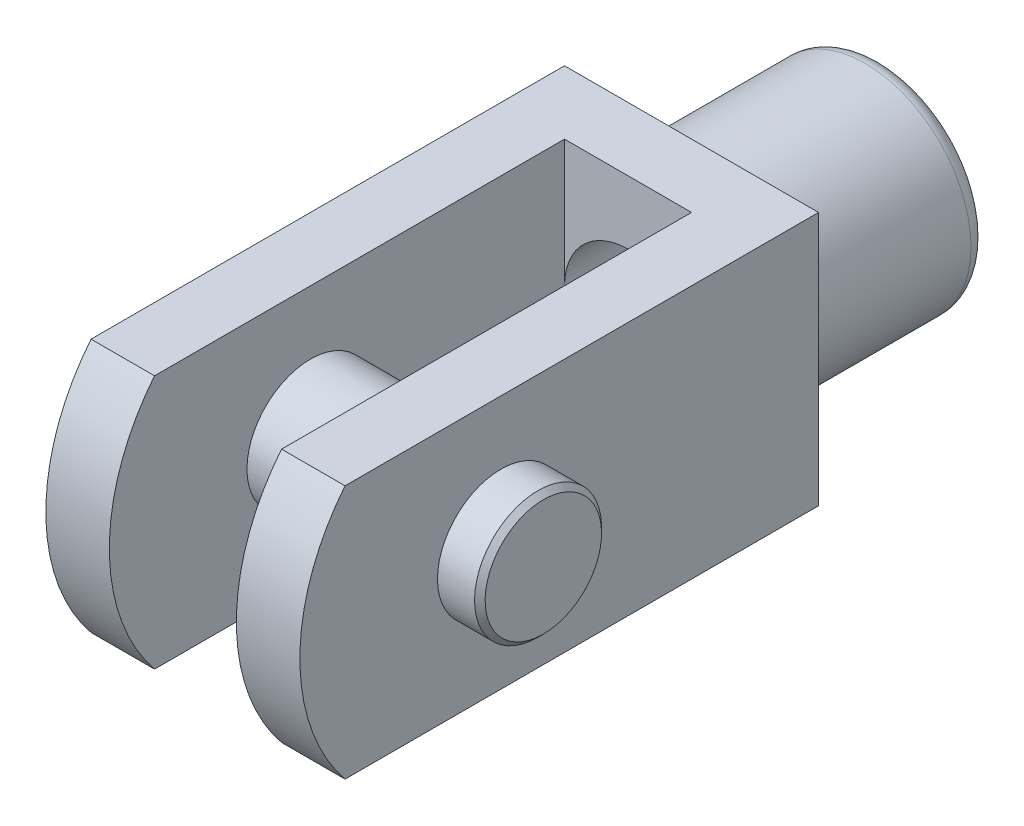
ISO-10303-21;
HEADER;
FILE_DESCRIPTION(('STEP AP214'),'2;1');
FILE_NAME('part.step','',(''),(''),'','','');
FILE_SCHEMA(('AUTOMOTIVE_DESIGN { 1 0 10303 214 1 1 1 1 }'));
ENDSEC;
DATA;
#1=APPLICATION_CONTEXT('core data for automotive mechanical design processes');
#2=APPLICATION_PROTOCOL_DEFINITION('international standard','automotive_design',2000,#1);
#3=PRODUCT_CONTEXT('',#1,'mechanical');
#4=PRODUCT('Part','Part','',(#3));
#5=PRODUCT_RELATED_PRODUCT_CATEGORY('part','',(#4));
#6=PRODUCT_DEFINITION_FORMATION('','',#4);
#7=PRODUCT_DEFINITION_CONTEXT('part definition',#1,'design');
#8=PRODUCT_DEFINITION('design','',#6,#7);
#9=PRODUCT_DEFINITION_SHAPE('','',#8);
#10=(LENGTH_UNIT() NAMED_UNIT(*) SI_UNIT(.MILLI.,.METRE.));
#11=(NAMED_UNIT(*) PLANE_ANGLE_UNIT() SI_UNIT($,.RADIAN.));
#12=(NAMED_UNIT(*) SI_UNIT($,.STERADIAN.) SOLID_ANGLE_UNIT());
#13=UNCERTAINTY_MEASURE_WITH_UNIT(LENGTH_MEASURE(1.E-05),#10,'distance_accuracy_value','');
#14=(GEOMETRIC_REPRESENTATION_CONTEXT(3) GLOBAL_UNCERTAINTY_ASSIGNED_CONTEXT((#13)) GLOBAL_UNIT_ASSIGNED_CONTEXT((#10,
#11,#12)) REPRESENTATION_CONTEXT('',''));
#15=CARTESIAN_POINT('',(0.,0.,0.));
#16=DIRECTION('',(0.,0.,1.));
#17=DIRECTION('',(1.,0.,0.));
#18=AXIS2_PLACEMENT_3D('',#15,#16,#17);
#19=CARTESIAN_POINT('',(16.,0.,30.));
#20=DIRECTION('',(1.,0.,0.));
#21=DIRECTION('',(0.,0.,-1.));
#22=AXIS2_PLACEMENT_3D('',#19,#20,#21);
#23=PLANE('',#22);
#24=CARTESIAN_POINT('',(16.0000000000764,0.,30.));
#25=DIRECTION('',(-1.,0.,0.));
#26=DIRECTION('',(0.,-1.,0.));
#27=AXIS2_PLACEMENT_3D('',#24,#25,#26);
#28=CIRCLE('',#27,5.49999999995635);
#29=CARTESIAN_POINT('',(16.0000000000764,-5.49999999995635,30.));
#30=VERTEX_POINT('',#29);
#31=EDGE_CURVE('E239',#30,#30,#28,.T.);
#32=ORIENTED_EDGE('',*,*,#31,.F.);
#33=EDGE_LOOP('',(#32));
#34=FACE_BOUND('',#33,.T.);
#35=ADVANCED_FACE('F16',(#34),#23,.T.);
#36=CARTESIAN_POINT('',(0.,0.,-18.));
#37=DIRECTION('',(0.,0.,-1.));
#38=DIRECTION('',(0.,1.,0.));
#39=AXIS2_PLACEMENT_3D('',#36,#37,#38);
#40=PLANE('',#39);
#41=CARTESIAN_POINT('',(0.,0.,-18.));
#42=DIRECTION('',(0.,0.,-1.));
#43=DIRECTION('',(0.,1.,0.));
#44=AXIS2_PLACEMENT_3D('',#41,#42,#43);
#45=CIRCLE('',#44,6.);
#46=CARTESIAN_POINT('',(0.,6.00000000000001,-18.));
#47=VERTEX_POINT('',#46);
#48=EDGE_CURVE('E172',#47,#47,#45,.F.);
#49=ORIENTED_EDGE('',*,*,#48,.T.);
#50=EDGE_LOOP('',(#49));
#51=FACE_BOUND('',#50,.T.);
#52=CARTESIAN_POINT('',(0.,0.,-18.));
#53=DIRECTION('',(0.,0.,1.));
#54=DIRECTION('',(0.,-1.,0.));
#55=AXIS2_PLACEMENT_3D('',#52,#53,#54);
#56=CIRCLE('',#55,8.4);
#57=CARTESIAN_POINT('',(0.,-8.4,-18.));
#58=VERTEX_POINT('',#57);
#59=CARTESIAN_POINT('',(0.,8.4,-18.));
#60=VERTEX_POINT('',#59);
#61=EDGE_CURVE('E176',#58,#60,#56,.T.);
#62=ORIENTED_EDGE('',*,*,#61,.F.);
#63=CARTESIAN_POINT('',(0.,0.,-18.));
#64=DIRECTION('',(0.,0.,1.));
#65=DIRECTION('',(0.,1.,0.));
#66=AXIS2_PLACEMENT_3D('',#63,#64,#65);
#67=CIRCLE('',#66,8.4);
#68=EDGE_CURVE('E235',#60,#58,#67,.T.);
#69=ORIENTED_EDGE('',*,*,#68,.F.);
#70=EDGE_LOOP('',(#62,#69));
#71=FACE_BOUND('',#70,.T.);
#72=ADVANCED_FACE('F193',(#51,#71),#40,.T.);
#73=CARTESIAN_POINT('',(0.,0.,-16.4));
#74=DIRECTION('',(0.,0.,-1.));
#75=DIRECTION('',(0.,1.,0.));
#76=AXIS2_PLACEMENT_3D('',#73,#74,#75);
#77=TOROIDAL_SURFACE('',#76,8.4,1.6);
#78=ORIENTED_EDGE('',*,*,#68,.T.);
#79=ORIENTED_EDGE('',*,*,#61,.T.);
#80=EDGE_LOOP('',(#78,#79));
#81=FACE_BOUND('',#80,.T.);
#82=CARTESIAN_POINT('',(0.,0.,-16.4));
#83=DIRECTION('',(0.,0.,1.));
#84=DIRECTION('',(0.,-1.,0.));
#85=AXIS2_PLACEMENT_3D('',#82,#83,#84);
#86=CIRCLE('',#85,10.);
#87=CARTESIAN_POINT('',(0.,-9.99999999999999,-16.4));
#88=VERTEX_POINT('',#87);
#89=EDGE_CURVE('E169',#88,#88,#86,.T.);
#90=ORIENTED_EDGE('',*,*,#89,.F.);
#91=EDGE_LOOP('',(#90));
#92=FACE_BOUND('',#91,.T.);
#93=ADVANCED_FACE('F181',(#81,#92),#77,.T.);
#94=CARTESIAN_POINT('',(15.5000000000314,0.,30.));
#95=DIRECTION('',(-1.,0.,0.));
#96=DIRECTION('',(0.,-1.,0.));
#97=AXIS2_PLACEMENT_3D('',#94,#95,#96);
#98=CONICAL_SURFACE('',#97,6.00000000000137,0.785398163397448);
#99=ORIENTED_EDGE('',*,*,#31,.T.);
#100=EDGE_LOOP('',(#99));
#101=FACE_BOUND('',#100,.T.);
#102=CARTESIAN_POINT('',(15.5,0.,30.));
#103=DIRECTION('',(-1.,0.,0.));
#104=DIRECTION('',(0.,0.,1.));
#105=AXIS2_PLACEMENT_3D('',#102,#103,#104);
#106=CIRCLE('',#105,6.);
#107=CARTESIAN_POINT('',(15.5,0.,36.));
#108=VERTEX_POINT('',#107);
#109=EDGE_CURVE('E114',#108,#108,#106,.T.);
#110=ORIENTED_EDGE('',*,*,#109,.F.);
#111=EDGE_LOOP('',(#110));
#112=FACE_BOUND('',#111,.T.);
#113=ADVANCED_FACE('F192',(#101,#112),#98,.T.);
#114=CARTESIAN_POINT('',(0.,0.,49.001));
#115=DIRECTION('',(0.,0.,-1.));
#116=DIRECTION('',(0.,1.,0.));
#117=AXIS2_PLACEMENT_3D('',#114,#115,#116);
#118=CYLINDRICAL_SURFACE('',#117,6.);
#119=CARTESIAN_POINT('',(0.,0.,6.));
#120=DIRECTION('',(0.,0.,-1.));
#121=DIRECTION('',(0.,1.,0.));
#122=AXIS2_PLACEMENT_3D('',#119,#120,#121);
#123=CIRCLE('',#122,6.);
#124=CARTESIAN_POINT('',(-6.,0.,6.));
#125=VERTEX_POINT('',#124);
#126=CARTESIAN_POINT('',(6.,0.,6.));
#127=VERTEX_POINT('',#126);
#128=EDGE_CURVE('E100',#125,#127,#123,.F.);
#129=ORIENTED_EDGE('',*,*,#128,.T.);
#130=CARTESIAN_POINT('',(0.,0.,6.));
#131=DIRECTION('',(0.,0.,-1.));
#132=DIRECTION('',(0.,1.,0.));
#133=AXIS2_PLACEMENT_3D('',#130,#131,#132);
#134=CIRCLE('',#133,6.);
#135=EDGE_CURVE('E106',#127,#125,#134,.F.);
#136=ORIENTED_EDGE('',*,*,#135,.T.);
#137=EDGE_LOOP('',(#129,#136));
#138=FACE_BOUND('',#137,.T.);
#139=ORIENTED_EDGE('',*,*,#48,.F.);
#140=EDGE_LOOP('',(#139));
#141=FACE_BOUND('',#140,.T.);
#142=ADVANCED_FACE('F116',(#138,#141),#118,.F.);
#143=CARTESIAN_POINT('',(16.,0.,30.));
#144=DIRECTION('',(-1.,0.,0.));
#145=DIRECTION('',(0.,0.,1.));
#146=AXIS2_PLACEMENT_3D('',#143,#144,#145);
#147=CYLINDRICAL_SURFACE('',#146,6.);
#148=CARTESIAN_POINT('',(6.,0.,30.));
#149=DIRECTION('',(-1.,0.,0.));
#150=DIRECTION('',(0.,0.,1.));
#151=AXIS2_PLACEMENT_3D('',#148,#149,#150);
#152=CIRCLE('',#151,6.);
#153=CARTESIAN_POINT('',(6.,0.,36.));
#154=VERTEX_POINT('',#153);
#155=EDGE_CURVE('E127',#154,#154,#152,.T.);
#156=ORIENTED_EDGE('',*,*,#155,.T.);
#157=EDGE_LOOP('',(#156));
#158=FACE_BOUND('',#157,.T.);
#159=CARTESIAN_POINT('',(-6.,0.,30.));
#160=DIRECTION('',(-1.,0.,0.));
#161=DIRECTION('',(0.,0.,1.));
#162=AXIS2_PLACEMENT_3D('',#159,#160,#161);
#163=CIRCLE('',#162,6.);
#164=CARTESIAN_POINT('',(-6.,0.,36.));
#165=VERTEX_POINT('',#164);
#166=EDGE_CURVE('E147',#165,#165,#163,.T.);
#167=ORIENTED_EDGE('',*,*,#166,.F.);
#168=EDGE_LOOP('',(#167));
#169=FACE_BOUND('',#168,.T.);
#170=ADVANCED_FACE('F428',(#158,#169),#147,.T.);
#171=CARTESIAN_POINT('',(0.,0.,-18.));
#172=DIRECTION('',(0.,0.,1.));
#173=DIRECTION('',(0.,-1.,0.));
#174=AXIS2_PLACEMENT_3D('',#171,#172,#173);
#175=CYLINDRICAL_SURFACE('',#174,10.);
#176=CARTESIAN_POINT('',(0.,0.,-1.6));
#177=DIRECTION('',(0.,0.,1.));
#178=DIRECTION('',(0.,-1.,0.));
#179=AXIS2_PLACEMENT_3D('',#176,#177,#178);
#180=CIRCLE('',#179,10.);
#181=CARTESIAN_POINT('',(0.,-10.,-1.6));
#182=VERTEX_POINT('',#181);
#183=EDGE_CURVE('E163',#182,#182,#180,.F.);
#184=ORIENTED_EDGE('',*,*,#183,.T.);
#185=EDGE_LOOP('',(#184));
#186=FACE_BOUND('',#185,.T.);
#187=ORIENTED_EDGE('',*,*,#89,.T.);
#188=EDGE_LOOP('',(#187));
#189=FACE_BOUND('',#188,.T.);
#190=ADVANCED_FACE('F409',(#186,#189),#175,.T.);
#191=CARTESIAN_POINT('',(16.,0.,30.));
#192=DIRECTION('',(-1.,0.,0.));
#193=DIRECTION('',(0.,0.,1.));
#194=AXIS2_PLACEMENT_3D('',#191,#192,#193);
#195=CYLINDRICAL_SURFACE('',#194,6.);
#196=ORIENTED_EDGE('',*,*,#109,.T.);
#197=EDGE_LOOP('',(#196));
#198=FACE_BOUND('',#197,.T.);
#199=CARTESIAN_POINT('',(12.,0.,30.));
#200=DIRECTION('',(-1.,0.,0.));
#201=DIRECTION('',(0.,0.,1.));
#202=AXIS2_PLACEMENT_3D('',#199,#200,#201);
#203=CIRCLE('',#202,6.);
#204=CARTESIAN_POINT('',(12.,0.,36.));
#205=VERTEX_POINT('',#204);
#206=EDGE_CURVE('E261',#205,#205,#203,.T.);
#207=ORIENTED_EDGE('',*,*,#206,.F.);
#208=EDGE_LOOP('',(#207));
#209=FACE_BOUND('',#208,.T.);
#210=ADVANCED_FACE('F402',(#198,#209),#195,.T.);
#211=CARTESIAN_POINT('',(-16.,0.,30.));
#212=DIRECTION('',(1.,0.,0.));
#213=DIRECTION('',(0.,0.,-1.));
#214=AXIS2_PLACEMENT_3D('',#211,#212,#213);
#215=PLANE('',#214);
#216=CARTESIAN_POINT('',(-15.9999999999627,0.,30.));
#217=DIRECTION('',(1.,0.,0.));
#218=DIRECTION('',(0.,0.,-1.));
#219=AXIS2_PLACEMENT_3D('',#216,#217,#218);
#220=CIRCLE('',#219,5.49999999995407);
#221=CARTESIAN_POINT('',(-15.9999999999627,0.,24.5000000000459));
#222=VERTEX_POINT('',#221);
#223=EDGE_CURVE('E264',#222,#222,#220,.T.);
#224=ORIENTED_EDGE('',*,*,#223,.F.);
#225=EDGE_LOOP('',(#224));
#226=FACE_BOUND('',#225,.T.);
#227=ADVANCED_FACE('F400',(#226),#215,.F.);
#228=CARTESIAN_POINT('',(-6.,12.,6.));
#229=DIRECTION('',(0.,0.,-1.));
#230=DIRECTION('',(0.,1.,0.));
#231=AXIS2_PLACEMENT_3D('',#228,#229,#230);
#232=PLANE('',#231);
#233=ORIENTED_EDGE('',*,*,#135,.F.);
#234=DIRECTION('',(0.,1.,0.));
#235=VECTOR('',#234,1.);
#236=CARTESIAN_POINT('',(6.,0.,6.));
#237=LINE('',#236,#235);
#238=CARTESIAN_POINT('',(6.,12.,6.));
#239=VERTEX_POINT('',#238);
#240=EDGE_CURVE('E110',#127,#239,#237,.T.);
#241=ORIENTED_EDGE('',*,*,#240,.T.);
#242=DIRECTION('',(1.,0.,0.));
#243=VECTOR('',#242,1.);
#244=CARTESIAN_POINT('',(12.,12.,6.));
#245=LINE('',#244,#243);
#246=CARTESIAN_POINT('',(-6.,12.,6.));
#247=VERTEX_POINT('',#246);
#248=EDGE_CURVE('E143',#239,#247,#245,.F.);
#249=ORIENTED_EDGE('',*,*,#248,.T.);
#250=DIRECTION('',(0.,1.,0.));
#251=VECTOR('',#250,1.);
#252=CARTESIAN_POINT('',(-6.,0.,6.));
#253=LINE('',#252,#251);
#254=EDGE_CURVE('E112',#125,#247,#253,.T.);
#255=ORIENTED_EDGE('',*,*,#254,.F.);
#256=EDGE_LOOP('',(#233,#241,#249,#255));
#257=FACE_BOUND('',#256,.T.);
#258=ADVANCED_FACE('F107',(#257),#232,.F.);
#259=CARTESIAN_POINT('',(-6.,12.,6.));
#260=DIRECTION('',(0.,0.,-1.));
#261=DIRECTION('',(0.,1.,0.));
#262=AXIS2_PLACEMENT_3D('',#259,#260,#261);
#263=PLANE('',#262);
#264=ORIENTED_EDGE('',*,*,#128,.F.);
#265=DIRECTION('',(0.,1.,0.));
#266=VECTOR('',#265,1.);
#267=CARTESIAN_POINT('',(-6.,0.,6.));
#268=LINE('',#267,#266);
#269=CARTESIAN_POINT('',(-6.,-12.,6.));
#270=VERTEX_POINT('',#269);
#271=EDGE_CURVE('E148',#270,#125,#268,.T.);
#272=ORIENTED_EDGE('',*,*,#271,.F.);
#273=DIRECTION('',(1.,0.,0.));
#274=VECTOR('',#273,1.);
#275=CARTESIAN_POINT('',(12.,-12.,6.));
#276=LINE('',#275,#274);
#277=CARTESIAN_POINT('',(6.,-12.,6.));
#278=VERTEX_POINT('',#277);
#279=EDGE_CURVE('E131',#270,#278,#276,.T.);
#280=ORIENTED_EDGE('',*,*,#279,.T.);
#281=DIRECTION('',(0.,1.,0.));
#282=VECTOR('',#281,1.);
#283=CARTESIAN_POINT('',(6.,0.,6.));
#284=LINE('',#283,#282);
#285=EDGE_CURVE('E118',#278,#127,#284,.T.);
#286=ORIENTED_EDGE('',*,*,#285,.T.);
#287=EDGE_LOOP('',(#264,#272,#280,#286));
#288=FACE_BOUND('',#287,.T.);
#289=ADVANCED_FACE('F130',(#288),#263,.F.);
#290=CARTESIAN_POINT('',(6.,0.,30.));
#291=DIRECTION('',(1.,0.,0.));
#292=DIRECTION('',(0.,0.,-1.));
#293=AXIS2_PLACEMENT_3D('',#290,#291,#292);
#294=PLANE('',#293);
#295=ORIENTED_EDGE('',*,*,#155,.F.);
#296=EDGE_LOOP('',(#295));
#297=FACE_BOUND('',#296,.T.);
#298=DIRECTION('',(0.,0.,-1.));
#299=VECTOR('',#298,1.);
#300=CARTESIAN_POINT('',(6.,12.,0.));
#301=LINE('',#300,#299);
#302=CARTESIAN_POINT('',(6.,12.,44.7309198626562));
#303=VERTEX_POINT('',#302);
#304=EDGE_CURVE('E126',#303,#239,#301,.T.);
#305=ORIENTED_EDGE('',*,*,#304,.T.);
#306=ORIENTED_EDGE('',*,*,#240,.F.);
#307=ORIENTED_EDGE('',*,*,#285,.F.);
#308=DIRECTION('',(0.,0.,1.));
#309=VECTOR('',#308,1.);
#310=CARTESIAN_POINT('',(6.,-12.,0.));
#311=LINE('',#310,#309);
#312=CARTESIAN_POINT('',(6.,-12.,44.7309198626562));
#313=VERTEX_POINT('',#312);
#314=EDGE_CURVE('E334',#278,#313,#311,.T.);
#315=ORIENTED_EDGE('',*,*,#314,.T.);
#316=CARTESIAN_POINT('',(6.,0.,30.));
#317=DIRECTION('',(-1.,0.,0.));
#318=DIRECTION('',(0.,0.,1.));
#319=AXIS2_PLACEMENT_3D('',#316,#317,#318);
#320=CIRCLE('',#319,19.);
#321=EDGE_CURVE('E256',#303,#313,#320,.F.);
#322=ORIENTED_EDGE('',*,*,#321,.F.);
#323=EDGE_LOOP('',(#305,#306,#307,#315,#322));
#324=FACE_BOUND('',#323,.T.);
#325=ADVANCED_FACE('F122',(#297,#324),#294,.F.);
#326=CARTESIAN_POINT('',(12.,0.,30.));
#327=DIRECTION('',(-1.,0.,0.));
#328=DIRECTION('',(0.,0.,1.));
#329=AXIS2_PLACEMENT_3D('',#326,#327,#328);
#330=CYLINDRICAL_SURFACE('',#329,19.);
#331=ORIENTED_EDGE('',*,*,#321,.T.);
#332=DIRECTION('',(1.,0.,0.));
#333=VECTOR('',#332,1.);
#334=CARTESIAN_POINT('',(12.,-12.,44.7309198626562));
#335=LINE('',#334,#333);
#336=CARTESIAN_POINT('',(12.,-12.,44.7309198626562));
#337=VERTEX_POINT('',#336);
#338=EDGE_CURVE('E317',#313,#337,#335,.T.);
#339=ORIENTED_EDGE('',*,*,#338,.T.);
#340=CARTESIAN_POINT('',(12.,0.,30.));
#341=DIRECTION('',(-1.,0.,0.));
#342=DIRECTION('',(0.,0.,1.));
#343=AXIS2_PLACEMENT_3D('',#340,#341,#342);
#344=CIRCLE('',#343,19.);
#345=CARTESIAN_POINT('',(12.,12.,44.7309198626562));
#346=VERTEX_POINT('',#345);
#347=EDGE_CURVE('E166',#346,#337,#344,.F.);
#348=ORIENTED_EDGE('',*,*,#347,.F.);
#349=DIRECTION('',(1.,0.,0.));
#350=VECTOR('',#349,1.);
#351=CARTESIAN_POINT('',(12.,12.,44.7309198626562));
#352=LINE('',#351,#350);
#353=EDGE_CURVE('E155',#346,#303,#352,.F.);
#354=ORIENTED_EDGE('',*,*,#353,.T.);
#355=EDGE_LOOP('',(#331,#339,#348,#354));
#356=FACE_BOUND('',#355,.T.);
#357=ADVANCED_FACE('F343',(#356),#330,.T.);
#358=CARTESIAN_POINT('',(-6.,0.,30.));
#359=DIRECTION('',(1.,0.,0.));
#360=DIRECTION('',(0.,0.,-1.));
#361=AXIS2_PLACEMENT_3D('',#358,#359,#360);
#362=PLANE('',#361);
#363=ORIENTED_EDGE('',*,*,#166,.T.);
#364=EDGE_LOOP('',(#363));
#365=FACE_BOUND('',#364,.T.);
#366=ORIENTED_EDGE('',*,*,#254,.T.);
#367=DIRECTION('',(0.,0.,-1.));
#368=VECTOR('',#367,1.);
#369=CARTESIAN_POINT('',(-6.,12.,0.));
#370=LINE('',#369,#368);
#371=CARTESIAN_POINT('',(-6.,12.,44.7309198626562));
#372=VERTEX_POINT('',#371);
#373=EDGE_CURVE('E139',#247,#372,#370,.F.);
#374=ORIENTED_EDGE('',*,*,#373,.T.);
#375=CARTESIAN_POINT('',(-6.,0.,30.));
#376=DIRECTION('',(-1.,0.,0.));
#377=DIRECTION('',(0.,0.,1.));
#378=AXIS2_PLACEMENT_3D('',#375,#376,#377);
#379=CIRCLE('',#378,19.);
#380=CARTESIAN_POINT('',(-6.,-12.,44.7309198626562));
#381=VERTEX_POINT('',#380);
#382=EDGE_CURVE('E267',#381,#372,#379,.T.);
#383=ORIENTED_EDGE('',*,*,#382,.F.);
#384=DIRECTION('',(0.,0.,1.));
#385=VECTOR('',#384,1.);
#386=CARTESIAN_POINT('',(-6.,-12.,0.));
#387=LINE('',#386,#385);
#388=EDGE_CURVE('E294',#381,#270,#387,.F.);
#389=ORIENTED_EDGE('',*,*,#388,.T.);
#390=ORIENTED_EDGE('',*,*,#271,.T.);
#391=EDGE_LOOP('',(#366,#374,#383,#389,#390));
#392=FACE_BOUND('',#391,.T.);
#393=ADVANCED_FACE('F214',(#365,#392),#362,.T.);
#394=CARTESIAN_POINT('',(0.,0.,-1.6));
#395=DIRECTION('',(0.,0.,1.));
#396=DIRECTION('',(0.,-1.,0.));
#397=AXIS2_PLACEMENT_3D('',#394,#395,#396);
#398=TOROIDAL_SURFACE('',#397,11.6,1.6);
#399=CARTESIAN_POINT('',(0.,0.,0.));
#400=DIRECTION('',(0.,0.,-1.));
#401=DIRECTION('',(0.,1.,0.));
#402=AXIS2_PLACEMENT_3D('',#399,#400,#401);
#403=CIRCLE('',#402,11.6);
#404=CARTESIAN_POINT('',(0.,11.6,0.));
#405=VERTEX_POINT('',#404);
#406=CARTESIAN_POINT('',(0.,-11.6,0.));
#407=VERTEX_POINT('',#406);
#408=EDGE_CURVE('E301',#405,#407,#403,.T.);
#409=ORIENTED_EDGE('',*,*,#408,.T.);
#410=CARTESIAN_POINT('',(0.,0.,0.));
#411=DIRECTION('',(0.,0.,-1.));
#412=DIRECTION('',(0.,-1.,0.));
#413=AXIS2_PLACEMENT_3D('',#410,#411,#412);
#414=CIRCLE('',#413,11.6);
#415=EDGE_CURVE('E321',#407,#405,#414,.T.);
#416=ORIENTED_EDGE('',*,*,#415,.T.);
#417=EDGE_LOOP('',(#409,#416));
#418=FACE_BOUND('',#417,.T.);
#419=ORIENTED_EDGE('',*,*,#183,.F.);
#420=EDGE_LOOP('',(#419));
#421=FACE_BOUND('',#420,.T.);
#422=ADVANCED_FACE('F208',(#418,#421),#398,.F.);
#423=CARTESIAN_POINT('',(12.,0.,30.));
#424=DIRECTION('',(1.,0.,0.));
#425=DIRECTION('',(0.,0.,-1.));
#426=AXIS2_PLACEMENT_3D('',#423,#424,#425);
#427=PLANE('',#426);
#428=ORIENTED_EDGE('',*,*,#206,.T.);
#429=EDGE_LOOP('',(#428));
#430=FACE_BOUND('',#429,.T.);
#431=ORIENTED_EDGE('',*,*,#347,.T.);
#432=DIRECTION('',(0.,0.,1.));
#433=VECTOR('',#432,1.);
#434=CARTESIAN_POINT('',(12.,-12.,0.));
#435=LINE('',#434,#433);
#436=CARTESIAN_POINT('',(12.,-12.,0.));
#437=VERTEX_POINT('',#436);
#438=EDGE_CURVE('E295',#337,#437,#435,.F.);
#439=ORIENTED_EDGE('',*,*,#438,.T.);
#440=DIRECTION('',(0.,-1.,0.));
#441=VECTOR('',#440,1.);
#442=CARTESIAN_POINT('',(12.,12.,0.));
#443=LINE('',#442,#441);
#444=CARTESIAN_POINT('',(12.,12.,0.));
#445=VERTEX_POINT('',#444);
#446=EDGE_CURVE('E300',#437,#445,#443,.F.);
#447=ORIENTED_EDGE('',*,*,#446,.T.);
#448=DIRECTION('',(0.,0.,-1.));
#449=VECTOR('',#448,1.);
#450=CARTESIAN_POINT('',(12.,12.,0.));
#451=LINE('',#450,#449);
#452=EDGE_CURVE('E159',#445,#346,#451,.F.);
#453=ORIENTED_EDGE('',*,*,#452,.T.);
#454=EDGE_LOOP('',(#431,#439,#447,#453));
#455=FACE_BOUND('',#454,.T.);
#456=ADVANCED_FACE('F213',(#430,#455),#427,.T.);
#457=CARTESIAN_POINT('',(-15.4999999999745,0.,30.));
#458=DIRECTION('',(1.,0.,0.));
#459=DIRECTION('',(0.,0.,-1.));
#460=AXIS2_PLACEMENT_3D('',#457,#458,#459);
#461=CONICAL_SURFACE('',#460,5.99999999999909,0.785398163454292);
#462=CARTESIAN_POINT('',(-15.5,0.,30.));
#463=DIRECTION('',(-1.,0.,0.));
#464=DIRECTION('',(0.,0.,1.));
#465=AXIS2_PLACEMENT_3D('',#462,#463,#464);
#466=CIRCLE('',#465,6.);
#467=CARTESIAN_POINT('',(-15.5,0.,36.));
#468=VERTEX_POINT('',#467);
#469=EDGE_CURVE('E278',#468,#468,#466,.F.);
#470=ORIENTED_EDGE('',*,*,#469,.F.);
#471=EDGE_LOOP('',(#470));
#472=FACE_BOUND('',#471,.T.);
#473=ORIENTED_EDGE('',*,*,#223,.T.);
#474=EDGE_LOOP('',(#473));
#475=FACE_BOUND('',#474,.T.);
#476=ADVANCED_FACE('F389',(#472,#475),#461,.T.);
#477=CARTESIAN_POINT('',(12.,12.,0.));
#478=DIRECTION('',(0.,-1.,0.));
#479=DIRECTION('',(0.,0.,-1.));
#480=AXIS2_PLACEMENT_3D('',#477,#478,#479);
#481=PLANE('',#480);
#482=ORIENTED_EDGE('',*,*,#248,.F.);
#483=ORIENTED_EDGE('',*,*,#304,.F.);
#484=ORIENTED_EDGE('',*,*,#353,.F.);
#485=ORIENTED_EDGE('',*,*,#452,.F.);
#486=DIRECTION('',(1.,0.,0.));
#487=VECTOR('',#486,1.);
#488=CARTESIAN_POINT('',(12.,12.,0.));
#489=LINE('',#488,#487);
#490=CARTESIAN_POINT('',(-12.,12.,0.));
#491=VERTEX_POINT('',#490);
#492=EDGE_CURVE('E285',#445,#491,#489,.F.);
#493=ORIENTED_EDGE('',*,*,#492,.T.);
#494=DIRECTION('',(0.,0.,-1.));
#495=VECTOR('',#494,1.);
#496=CARTESIAN_POINT('',(-12.,12.,30.));
#497=LINE('',#496,#495);
#498=CARTESIAN_POINT('',(-12.,12.,44.7309198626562));
#499=VERTEX_POINT('',#498);
#500=EDGE_CURVE('E270',#491,#499,#497,.F.);
#501=ORIENTED_EDGE('',*,*,#500,.T.);
#502=DIRECTION('',(-1.,0.,0.));
#503=VECTOR('',#502,1.);
#504=CARTESIAN_POINT('',(12.,12.,44.7309198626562));
#505=LINE('',#504,#503);
#506=EDGE_CURVE('E142',#372,#499,#505,.T.);
#507=ORIENTED_EDGE('',*,*,#506,.F.);
#508=ORIENTED_EDGE('',*,*,#373,.F.);
#509=EDGE_LOOP('',(#482,#483,#484,#485,#493,#501,#507,#508));
#510=FACE_BOUND('',#509,.T.);
#511=ADVANCED_FACE('F345',(#510),#481,.F.);
#512=CARTESIAN_POINT('',(12.,0.,30.));
#513=DIRECTION('',(-1.,0.,0.));
#514=DIRECTION('',(0.,0.,1.));
#515=AXIS2_PLACEMENT_3D('',#512,#513,#514);
#516=CYLINDRICAL_SURFACE('',#515,19.);
#517=CARTESIAN_POINT('',(-12.,0.,30.));
#518=DIRECTION('',(-1.,0.,0.));
#519=DIRECTION('',(0.,0.,1.));
#520=AXIS2_PLACEMENT_3D('',#517,#518,#519);
#521=CIRCLE('',#520,19.);
#522=CARTESIAN_POINT('',(-12.,-12.,44.7309198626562));
#523=VERTEX_POINT('',#522);
#524=EDGE_CURVE('E268',#499,#523,#521,.F.);
#525=ORIENTED_EDGE('',*,*,#524,.T.);
#526=DIRECTION('',(1.,0.,0.));
#527=VECTOR('',#526,1.);
#528=CARTESIAN_POINT('',(12.,-12.,44.7309198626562));
#529=LINE('',#528,#527);
#530=EDGE_CURVE('E292',#523,#381,#529,.T.);
#531=ORIENTED_EDGE('',*,*,#530,.T.);
#532=ORIENTED_EDGE('',*,*,#382,.T.);
#533=ORIENTED_EDGE('',*,*,#506,.T.);
#534=EDGE_LOOP('',(#525,#531,#532,#533));
#535=FACE_BOUND('',#534,.T.);
#536=ADVANCED_FACE('F385',(#535),#516,.T.);
#537=CARTESIAN_POINT('',(12.,-12.,0.));
#538=DIRECTION('',(0.,1.,0.));
#539=DIRECTION('',(0.,0.,1.));
#540=AXIS2_PLACEMENT_3D('',#537,#538,#539);
#541=PLANE('',#540);
#542=ORIENTED_EDGE('',*,*,#530,.F.);
#543=DIRECTION('',(0.,0.,-1.));
#544=VECTOR('',#543,1.);
#545=CARTESIAN_POINT('',(-12.,-12.,30.));
#546=LINE('',#545,#544);
#547=CARTESIAN_POINT('',(-12.,-12.,0.));
#548=VERTEX_POINT('',#547);
#549=EDGE_CURVE('E269',#523,#548,#546,.T.);
#550=ORIENTED_EDGE('',*,*,#549,.T.);
#551=DIRECTION('',(1.,0.,0.));
#552=VECTOR('',#551,1.);
#553=CARTESIAN_POINT('',(12.,-12.,0.));
#554=LINE('',#553,#552);
#555=EDGE_CURVE('E37',#548,#437,#554,.T.);
#556=ORIENTED_EDGE('',*,*,#555,.T.);
#557=ORIENTED_EDGE('',*,*,#438,.F.);
#558=ORIENTED_EDGE('',*,*,#338,.F.);
#559=ORIENTED_EDGE('',*,*,#314,.F.);
#560=ORIENTED_EDGE('',*,*,#279,.F.);
#561=ORIENTED_EDGE('',*,*,#388,.F.);
#562=EDGE_LOOP('',(#542,#550,#556,#557,#558,#559,#560,#561));
#563=FACE_BOUND('',#562,.T.);
#564=ADVANCED_FACE('F340',(#563),#541,.F.);
#565=CARTESIAN_POINT('',(12.,12.,0.));
#566=DIRECTION('',(0.,0.,1.));
#567=DIRECTION('',(0.,-1.,0.));
#568=AXIS2_PLACEMENT_3D('',#565,#566,#567);
#569=PLANE('',#568);
#570=ORIENTED_EDGE('',*,*,#492,.F.);
#571=ORIENTED_EDGE('',*,*,#446,.F.);
#572=ORIENTED_EDGE('',*,*,#555,.F.);
#573=DIRECTION('',(0.,1.,0.));
#574=VECTOR('',#573,1.);
#575=CARTESIAN_POINT('',(-12.,0.,0.));
#576=LINE('',#575,#574);
#577=EDGE_CURVE('E28',#548,#491,#576,.T.);
#578=ORIENTED_EDGE('',*,*,#577,.T.);
#579=EDGE_LOOP('',(#570,#571,#572,#578));
#580=FACE_BOUND('',#579,.T.);
#581=ORIENTED_EDGE('',*,*,#415,.F.);
#582=ORIENTED_EDGE('',*,*,#408,.F.);
#583=EDGE_LOOP('',(#581,#582));
#584=FACE_BOUND('',#583,.T.);
#585=ADVANCED_FACE('F348',(#580,#584),#569,.F.);
#586=CARTESIAN_POINT('',(16.,0.,30.));
#587=DIRECTION('',(-1.,0.,0.));
#588=DIRECTION('',(0.,0.,1.));
#589=AXIS2_PLACEMENT_3D('',#586,#587,#588);
#590=CYLINDRICAL_SURFACE('',#589,6.);
#591=ORIENTED_EDGE('',*,*,#469,.T.);
#592=EDGE_LOOP('',(#591));
#593=FACE_BOUND('',#592,.T.);
#594=CARTESIAN_POINT('',(-12.,0.,30.));
#595=DIRECTION('',(-1.,0.,0.));
#596=DIRECTION('',(0.,0.,1.));
#597=AXIS2_PLACEMENT_3D('',#594,#595,#596);
#598=CIRCLE('',#597,6.);
#599=CARTESIAN_POINT('',(-12.,0.,36.));
#600=VERTEX_POINT('',#599);
#601=EDGE_CURVE('E11',#600,#600,#598,.T.);
#602=ORIENTED_EDGE('',*,*,#601,.T.);
#603=EDGE_LOOP('',(#602));
#604=FACE_BOUND('',#603,.T.);
#605=ADVANCED_FACE('F352',(#593,#604),#590,.T.);
#606=CARTESIAN_POINT('',(-12.,0.,30.));
#607=DIRECTION('',(1.,0.,0.));
#608=DIRECTION('',(0.,0.,-1.));
#609=AXIS2_PLACEMENT_3D('',#606,#607,#608);
#610=PLANE('',#609);
#611=ORIENTED_EDGE('',*,*,#601,.F.);
#612=EDGE_LOOP('',(#611));
#613=FACE_BOUND('',#612,.T.);
#614=ORIENTED_EDGE('',*,*,#549,.F.);
#615=ORIENTED_EDGE('',*,*,#524,.F.);
#616=ORIENTED_EDGE('',*,*,#500,.F.);
#617=ORIENTED_EDGE('',*,*,#577,.F.);
#618=EDGE_LOOP('',(#614,#615,#616,#617));
#619=FACE_BOUND('',#618,.T.);
#620=ADVANCED_FACE('F18',(#613,#619),#610,.F.);
#621=CLOSED_SHELL('',(#35,#72,#93,#113,#142,#170,#190,#210,#227,#258,#289,#325,#357,#393,#422,
#456,#476,#511,#536,#564,#585,#605,#620));
#622=MANIFOLD_SOLID_BREP('B1',#621);
#623=ADVANCED_BREP_SHAPE_REPRESENTATION('',(#18,#622),#14);
#624=SHAPE_DEFINITION_REPRESENTATION(#9,#623);
ENDSEC;
END-ISO-10303-21;
